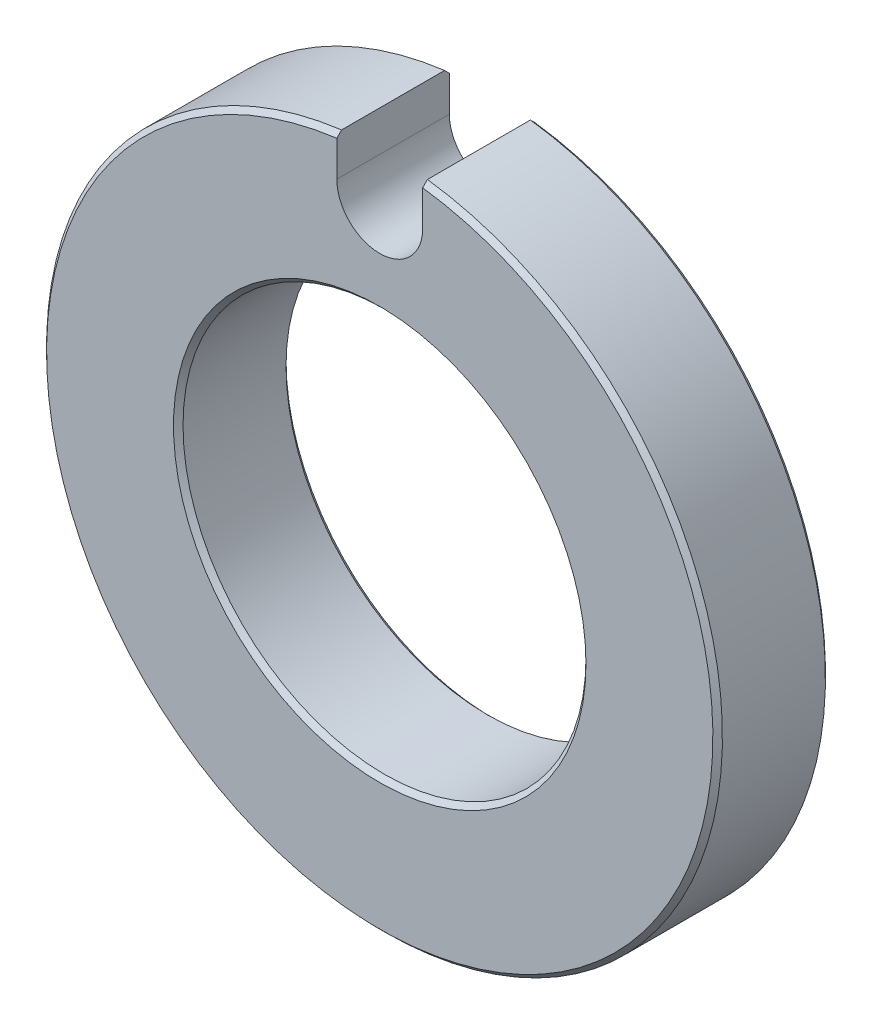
ISO-10303-21;
HEADER;
FILE_DESCRIPTION(('STEP AP214'),'2;1');
FILE_NAME('part.step','',(''),(''),'','','');
FILE_SCHEMA(('AUTOMOTIVE_DESIGN { 1 0 10303 214 1 1 1 1 }'));
ENDSEC;
DATA;
#1=APPLICATION_CONTEXT('core data for automotive mechanical design processes');
#2=APPLICATION_PROTOCOL_DEFINITION('international standard','automotive_design',2000,#1);
#3=PRODUCT_CONTEXT('',#1,'mechanical');
#4=PRODUCT('Part','Part','',(#3));
#5=PRODUCT_RELATED_PRODUCT_CATEGORY('part','',(#4));
#6=PRODUCT_DEFINITION_FORMATION('','',#4);
#7=PRODUCT_DEFINITION_CONTEXT('part definition',#1,'design');
#8=PRODUCT_DEFINITION('design','',#6,#7);
#9=PRODUCT_DEFINITION_SHAPE('','',#8);
#10=(LENGTH_UNIT() NAMED_UNIT(*) SI_UNIT(.MILLI.,.METRE.));
#11=(NAMED_UNIT(*) PLANE_ANGLE_UNIT() SI_UNIT($,.RADIAN.));
#12=(NAMED_UNIT(*) SI_UNIT($,.STERADIAN.) SOLID_ANGLE_UNIT());
#13=UNCERTAINTY_MEASURE_WITH_UNIT(LENGTH_MEASURE(1.E-05),#10,'distance_accuracy_value','');
#14=(GEOMETRIC_REPRESENTATION_CONTEXT(3) GLOBAL_UNCERTAINTY_ASSIGNED_CONTEXT((#13)) GLOBAL_UNIT_ASSIGNED_CONTEXT((#10,
#11,#12)) REPRESENTATION_CONTEXT('',''));
#15=CARTESIAN_POINT('',(0.,0.,0.));
#16=DIRECTION('',(0.,0.,1.));
#17=DIRECTION('',(1.,0.,0.));
#18=AXIS2_PLACEMENT_3D('',#15,#16,#17);
#19=CARTESIAN_POINT('',(0.,0.,5.9944));
#20=DIRECTION('',(0.,0.,1.));
#21=DIRECTION('',(1.,0.,0.));
#22=AXIS2_PLACEMENT_3D('',#19,#20,#21);
#23=PLANE('',#22);
#24=CARTESIAN_POINT('',(0.,0.,5.9944));
#25=DIRECTION('',(0.,0.,1.));
#26=DIRECTION('',(1.,0.,0.));
#27=AXIS2_PLACEMENT_3D('',#24,#25,#26);
#28=CIRCLE('',#27,10.9855);
#29=CARTESIAN_POINT('',(10.9855,0.,5.9944));
#30=VERTEX_POINT('',#29);
#31=EDGE_CURVE('E205',#30,#30,#28,.F.);
#32=ORIENTED_EDGE('',*,*,#31,.T.);
#33=EDGE_LOOP('',(#32));
#34=FACE_BOUND('',#33,.T.);
#35=CARTESIAN_POINT('',(0.,0.,5.9944));
#36=DIRECTION('',(0.,0.,1.));
#37=DIRECTION('',(1.,0.,0.));
#38=AXIS2_PLACEMENT_3D('',#35,#36,#37);
#39=CIRCLE('',#38,17.746);
#40=CARTESIAN_POINT('',(-2.286,17.5981453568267,5.9944));
#41=VERTEX_POINT('',#40);
#42=CARTESIAN_POINT('',(2.286,17.5981453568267,5.9944));
#43=VERTEX_POINT('',#42);
#44=EDGE_CURVE('E115',#41,#43,#39,.T.);
#45=ORIENTED_EDGE('',*,*,#44,.T.);
#46=DIRECTION('',(0.,1.,0.));
#47=VECTOR('',#46,1.);
#48=CARTESIAN_POINT('',(2.286,19.5199,5.9944));
#49=LINE('',#48,#47);
#50=CARTESIAN_POINT('',(2.286,15.7099,5.9944));
#51=VERTEX_POINT('',#50);
#52=EDGE_CURVE('E106',#51,#43,#49,.T.);
#53=ORIENTED_EDGE('',*,*,#52,.F.);
#54=CARTESIAN_POINT('',(0.,15.7099,5.9944));
#55=DIRECTION('',(0.,0.,1.));
#56=DIRECTION('',(1.,0.,0.));
#57=AXIS2_PLACEMENT_3D('',#54,#55,#56);
#58=CIRCLE('',#57,2.286);
#59=CARTESIAN_POINT('',(-2.286,15.7099,5.9944));
#60=VERTEX_POINT('',#59);
#61=EDGE_CURVE('E96',#60,#51,#58,.T.);
#62=ORIENTED_EDGE('',*,*,#61,.F.);
#63=DIRECTION('',(0.,-1.,0.));
#64=VECTOR('',#63,1.);
#65=CARTESIAN_POINT('',(-2.286,15.7099,5.9944));
#66=LINE('',#65,#64);
#67=EDGE_CURVE('E116',#41,#60,#66,.T.);
#68=ORIENTED_EDGE('',*,*,#67,.F.);
#69=EDGE_LOOP('',(#45,#53,#62,#68));
#70=FACE_BOUND('',#69,.T.);
#71=ADVANCED_FACE('F37',(#34,#70),#23,.T.);
#72=CARTESIAN_POINT('',(0.,0.,0.));
#73=DIRECTION('',(0.,0.,1.));
#74=DIRECTION('',(1.,0.,0.));
#75=AXIS2_PLACEMENT_3D('',#72,#73,#74);
#76=PLANE('',#75);
#77=CARTESIAN_POINT('',(0.,0.,0.));
#78=DIRECTION('',(0.,0.,1.));
#79=DIRECTION('',(1.,0.,0.));
#80=AXIS2_PLACEMENT_3D('',#77,#78,#79);
#81=CIRCLE('',#80,10.9855);
#82=CARTESIAN_POINT('',(10.9855,0.,0.));
#83=VERTEX_POINT('',#82);
#84=EDGE_CURVE('E194',#83,#83,#81,.T.);
#85=ORIENTED_EDGE('',*,*,#84,.T.);
#86=EDGE_LOOP('',(#85));
#87=FACE_BOUND('',#86,.T.);
#88=DIRECTION('',(0.,1.,0.));
#89=VECTOR('',#88,1.);
#90=CARTESIAN_POINT('',(2.286,19.5199,0.));
#91=LINE('',#90,#89);
#92=CARTESIAN_POINT('',(2.286,15.7099,0.));
#93=VERTEX_POINT('',#92);
#94=CARTESIAN_POINT('',(2.286,17.5981453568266,0.));
#95=VERTEX_POINT('',#94);
#96=EDGE_CURVE('E111',#93,#95,#91,.T.);
#97=ORIENTED_EDGE('',*,*,#96,.T.);
#98=CARTESIAN_POINT('',(0.,0.,0.));
#99=DIRECTION('',(0.,0.,1.));
#100=DIRECTION('',(1.,0.,0.));
#101=AXIS2_PLACEMENT_3D('',#98,#99,#100);
#102=CIRCLE('',#101,17.746);
#103=CARTESIAN_POINT('',(-2.286,17.5981453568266,0.));
#104=VERTEX_POINT('',#103);
#105=EDGE_CURVE('E202',#95,#104,#102,.F.);
#106=ORIENTED_EDGE('',*,*,#105,.T.);
#107=DIRECTION('',(0.,-1.,0.));
#108=VECTOR('',#107,1.);
#109=CARTESIAN_POINT('',(-2.286,15.7099,0.));
#110=LINE('',#109,#108);
#111=CARTESIAN_POINT('',(-2.286,15.7099,0.));
#112=VERTEX_POINT('',#111);
#113=EDGE_CURVE('E107',#104,#112,#110,.T.);
#114=ORIENTED_EDGE('',*,*,#113,.T.);
#115=CARTESIAN_POINT('',(0.,15.7099,0.));
#116=DIRECTION('',(0.,0.,1.));
#117=DIRECTION('',(1.,0.,0.));
#118=AXIS2_PLACEMENT_3D('',#115,#116,#117);
#119=CIRCLE('',#118,2.286);
#120=EDGE_CURVE('E120',#112,#93,#119,.T.);
#121=ORIENTED_EDGE('',*,*,#120,.T.);
#122=EDGE_LOOP('',(#97,#106,#114,#121));
#123=FACE_BOUND('',#122,.T.);
#124=ADVANCED_FACE('F170',(#87,#123),#76,.F.);
#125=CARTESIAN_POINT('',(0.,0.,5.9944));
#126=DIRECTION('',(0.,0.,-1.));
#127=DIRECTION('',(-1.,0.,0.));
#128=AXIS2_PLACEMENT_3D('',#125,#126,#127);
#129=CYLINDRICAL_SURFACE('',#128,18.);
#130=DIRECTION('',(0.,0.,-1.));
#131=VECTOR('',#130,1.);
#132=CARTESIAN_POINT('',(2.286,17.8542489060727,5.9944));
#133=LINE('',#132,#131);
#134=CARTESIAN_POINT('',(2.286,17.8542489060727,5.74040000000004));
#135=VERTEX_POINT('',#134);
#136=CARTESIAN_POINT('',(2.286,17.8542489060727,0.254000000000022));
#137=VERTEX_POINT('',#136);
#138=EDGE_CURVE('E65',#135,#137,#133,.T.);
#139=ORIENTED_EDGE('',*,*,#138,.F.);
#140=CARTESIAN_POINT('',(0.,0.,5.74040000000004));
#141=DIRECTION('',(0.,0.,1.));
#142=DIRECTION('',(1.,0.,0.));
#143=AXIS2_PLACEMENT_3D('',#140,#141,#142);
#144=CIRCLE('',#143,18.);
#145=CARTESIAN_POINT('',(-2.286,17.8542489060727,5.74040000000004));
#146=VERTEX_POINT('',#145);
#147=EDGE_CURVE('E189',#135,#146,#144,.F.);
#148=ORIENTED_EDGE('',*,*,#147,.T.);
#149=DIRECTION('',(0.,0.,-1.));
#150=VECTOR('',#149,1.);
#151=CARTESIAN_POINT('',(-2.286,17.8542489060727,5.9944));
#152=LINE('',#151,#150);
#153=CARTESIAN_POINT('',(-2.286,17.8542489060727,0.254000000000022));
#154=VERTEX_POINT('',#153);
#155=EDGE_CURVE('E57',#154,#146,#152,.F.);
#156=ORIENTED_EDGE('',*,*,#155,.F.);
#157=CARTESIAN_POINT('',(0.,0.,0.254000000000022));
#158=DIRECTION('',(0.,0.,1.));
#159=DIRECTION('',(1.,0.,0.));
#160=AXIS2_PLACEMENT_3D('',#157,#158,#159);
#161=CIRCLE('',#160,18.);
#162=EDGE_CURVE('E191',#154,#137,#161,.T.);
#163=ORIENTED_EDGE('',*,*,#162,.T.);
#164=EDGE_LOOP('',(#139,#148,#156,#163));
#165=FACE_BOUND('',#164,.T.);
#166=ADVANCED_FACE('F176',(#165),#129,.T.);
#167=CARTESIAN_POINT('',(0.,0.,0.254000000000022));
#168=DIRECTION('',(0.,0.,1.));
#169=DIRECTION('',(1.,0.,0.));
#170=AXIS2_PLACEMENT_3D('',#167,#168,#169);
#171=CONICAL_SURFACE('',#170,18.,0.785398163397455);
#172=ORIENTED_EDGE('',*,*,#105,.F.);
#173=CARTESIAN_POINT('',(2.286,14.7410604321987,-2.82873957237));
#174=CARTESIAN_POINT('',(2.286,15.2380157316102,-2.33763869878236));
#175=CARTESIAN_POINT('',(2.286,15.7346953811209,-1.84625911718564));
#176=CARTESIAN_POINT('',(2.286,16.7276121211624,-0.863053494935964));
#177=CARTESIAN_POINT('',(2.286,17.2238492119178,-0.371227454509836));
#178=CARTESIAN_POINT('',(2.286,18.2159899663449,0.612760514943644));
#179=CARTESIAN_POINT('',(2.286,18.7118936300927,1.10492244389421));
#180=CARTESIAN_POINT('',(2.286,19.7034334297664,2.08951622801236));
#181=CARTESIAN_POINT('',(2.286,20.1990695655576,2.58194808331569));
#182=CARTESIAN_POINT('',(2.286,20.6946045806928,3.07448161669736));
#183=B_SPLINE_CURVE_WITH_KNOTS('',3,(#173,#174,#175,#176,#177,#178,#179,#180,#181,#182),
.UNSPECIFIED.,.F.,.F.,(4,2,2,2,4),(0.,2.09602011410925,4.1920391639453,6.28805773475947,
8.38407736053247),.UNSPECIFIED.);
#184=EDGE_CURVE('E192',#95,#137,#183,.T.);
#185=ORIENTED_EDGE('',*,*,#184,.T.);
#186=ORIENTED_EDGE('',*,*,#162,.F.);
#187=CARTESIAN_POINT('',(-2.286,20.6946045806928,3.07448161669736));
#188=CARTESIAN_POINT('',(-2.286,20.1990695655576,2.58194808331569));
#189=CARTESIAN_POINT('',(-2.286,19.7034334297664,2.08951622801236));
#190=CARTESIAN_POINT('',(-2.286,18.7118936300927,1.10492244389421));
#191=CARTESIAN_POINT('',(-2.286,18.2159899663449,0.612760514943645));
#192=CARTESIAN_POINT('',(-2.286,17.2238492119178,-0.371227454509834));
#193=CARTESIAN_POINT('',(-2.286,16.7276121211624,-0.863053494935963));
#194=CARTESIAN_POINT('',(-2.286,15.7346953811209,-1.84625911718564));
#195=CARTESIAN_POINT('',(-2.286,15.2380157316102,-2.33763869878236));
#196=CARTESIAN_POINT('',(-2.286,14.7410604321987,-2.82873957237));
#197=B_SPLINE_CURVE_WITH_KNOTS('',3,(#187,#188,#189,#190,#191,#192,#193,#194,#195,#196),
.UNSPECIFIED.,.F.,.F.,(4,2,2,2,4),(0.,2.096019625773,4.19203819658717,6.28805724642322,
8.38407736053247),.UNSPECIFIED.);
#198=EDGE_CURVE('E127',#154,#104,#197,.T.);
#199=ORIENTED_EDGE('',*,*,#198,.T.);
#200=EDGE_LOOP('',(#172,#185,#186,#199));
#201=FACE_BOUND('',#200,.T.);
#202=ADVANCED_FACE('F136',(#201),#171,.T.);
#203=CARTESIAN_POINT('',(0.,0.,5.9944));
#204=DIRECTION('',(0.,0.,-1.));
#205=DIRECTION('',(-1.,0.,0.));
#206=AXIS2_PLACEMENT_3D('',#203,#204,#205);
#207=CONICAL_SURFACE('',#206,17.746,0.785398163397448);
#208=ORIENTED_EDGE('',*,*,#147,.F.);
#209=CARTESIAN_POINT('',(2.286,20.6946045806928,2.91991838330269));
#210=CARTESIAN_POINT('',(2.286,20.1990695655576,3.41245191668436));
#211=CARTESIAN_POINT('',(2.286,19.7034334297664,3.90488377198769));
#212=CARTESIAN_POINT('',(2.286,18.7118936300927,4.88947755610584));
#213=CARTESIAN_POINT('',(2.286,18.2159899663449,5.3816394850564));
#214=CARTESIAN_POINT('',(2.286,17.2238492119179,6.36562745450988));
#215=CARTESIAN_POINT('',(2.286,16.7276121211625,6.85745349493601));
#216=CARTESIAN_POINT('',(2.286,15.734695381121,7.84065911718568));
#217=CARTESIAN_POINT('',(2.286,15.2380157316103,8.3320386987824));
#218=CARTESIAN_POINT('',(2.286,14.7410604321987,8.82313957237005));
#219=B_SPLINE_CURVE_WITH_KNOTS('',3,(#209,#210,#211,#212,#213,#214,#215,#216,#217,#218),
.UNSPECIFIED.,.F.,.F.,(4,2,2,2,4),(0.,2.09601962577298,4.19203819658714,6.28805724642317,
8.38407736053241),.UNSPECIFIED.);
#220=EDGE_CURVE('E11',#135,#43,#219,.T.);
#221=ORIENTED_EDGE('',*,*,#220,.T.);
#222=ORIENTED_EDGE('',*,*,#44,.F.);
#223=CARTESIAN_POINT('',(-2.286,14.7410604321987,8.82313957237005));
#224=CARTESIAN_POINT('',(-2.286,15.2380157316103,8.3320386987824));
#225=CARTESIAN_POINT('',(-2.286,15.734695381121,7.84065911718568));
#226=CARTESIAN_POINT('',(-2.286,16.7276121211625,6.85745349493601));
#227=CARTESIAN_POINT('',(-2.286,17.2238492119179,6.36562745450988));
#228=CARTESIAN_POINT('',(-2.286,18.2159899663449,5.3816394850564));
#229=CARTESIAN_POINT('',(-2.286,18.7118936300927,4.88947755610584));
#230=CARTESIAN_POINT('',(-2.286,19.7034334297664,3.90488377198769));
#231=CARTESIAN_POINT('',(-2.286,20.1990695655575,3.41245191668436));
#232=CARTESIAN_POINT('',(-2.286,20.6946045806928,2.91991838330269));
#233=B_SPLINE_CURVE_WITH_KNOTS('',3,(#223,#224,#225,#226,#227,#228,#229,#230,#231,#232),
.UNSPECIFIED.,.F.,.F.,(4,2,2,2,4),(0.,2.09602011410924,4.19203916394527,6.28805773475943,
8.38407736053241),.UNSPECIFIED.);
#234=EDGE_CURVE('E50',#41,#146,#233,.T.);
#235=ORIENTED_EDGE('',*,*,#234,.T.);
#236=EDGE_LOOP('',(#208,#221,#222,#235));
#237=FACE_BOUND('',#236,.T.);
#238=ADVANCED_FACE('F151',(#237),#207,.T.);
#239=CARTESIAN_POINT('',(0.,0.,5.9944));
#240=DIRECTION('',(0.,0.,-1.));
#241=DIRECTION('',(-1.,0.,0.));
#242=AXIS2_PLACEMENT_3D('',#239,#240,#241);
#243=CYLINDRICAL_SURFACE('',#242,10.7315);
#244=CARTESIAN_POINT('',(0.,0.,0.253999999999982));
#245=DIRECTION('',(0.,0.,1.));
#246=DIRECTION('',(1.,0.,0.));
#247=AXIS2_PLACEMENT_3D('',#244,#245,#246);
#248=CIRCLE('',#247,10.7315);
#249=CARTESIAN_POINT('',(-10.7315,0.,0.253999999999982));
#250=VERTEX_POINT('',#249);
#251=EDGE_CURVE('E149',#250,#250,#248,.F.);
#252=CARTESIAN_POINT('',(0.,0.,5.74039999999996));
#253=DIRECTION('',(0.,0.,1.));
#254=DIRECTION('',(1.,0.,0.));
#255=AXIS2_PLACEMENT_3D('',#252,#253,#254);
#256=CIRCLE('',#255,10.7315);
#257=CARTESIAN_POINT('',(-10.7315,0.,5.74039999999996));
#258=VERTEX_POINT('',#257);
#259=EDGE_CURVE('E207',#258,#258,#256,.T.);
#260=CARTESIAN_POINT('',(-10.7315,0.,0.253999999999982));
#261=CARTESIAN_POINT('',(-10.7315,0.,0.311149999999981));
#262=CARTESIAN_POINT('',(-10.7315,0.,0.368299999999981));
#263=CARTESIAN_POINT('',(-10.7315,0.,0.482599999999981));
#264=CARTESIAN_POINT('',(-10.7315,0.,0.53974999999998));
#265=CARTESIAN_POINT('',(-10.7315,0.,0.65404999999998));
#266=CARTESIAN_POINT('',(-10.7315,0.,0.71119999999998));
#267=CARTESIAN_POINT('',(-10.7315,0.,0.82549999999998));
#268=CARTESIAN_POINT('',(-10.7315,0.,0.88264999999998));
#269=CARTESIAN_POINT('',(-10.7315,0.,0.996949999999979));
#270=CARTESIAN_POINT('',(-10.7315,0.,1.05409999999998));
#271=CARTESIAN_POINT('',(-10.7315,0.,1.16839999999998));
#272=CARTESIAN_POINT('',(-10.7315,0.,1.22554999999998));
#273=CARTESIAN_POINT('',(-10.7315,0.,1.33984999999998));
#274=CARTESIAN_POINT('',(-10.7315,0.,1.39699999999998));
#275=CARTESIAN_POINT('',(-10.7315,0.,1.51129999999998));
#276=CARTESIAN_POINT('',(-10.7315,0.,1.56844999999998));
#277=CARTESIAN_POINT('',(-10.7315,0.,1.68274999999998));
#278=CARTESIAN_POINT('',(-10.7315,0.,1.73989999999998));
#279=CARTESIAN_POINT('',(-10.7315,0.,1.85419999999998));
#280=CARTESIAN_POINT('',(-10.7315,0.,1.91134999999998));
#281=CARTESIAN_POINT('',(-10.7315,0.,2.02564999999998));
#282=CARTESIAN_POINT('',(-10.7315,0.,2.08279999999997));
#283=CARTESIAN_POINT('',(-10.7315,0.,2.19709999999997));
#284=CARTESIAN_POINT('',(-10.7315,0.,2.25424999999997));
#285=CARTESIAN_POINT('',(-10.7315,0.,2.36854999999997));
#286=CARTESIAN_POINT('',(-10.7315,0.,2.42569999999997));
#287=CARTESIAN_POINT('',(-10.7315,0.,2.53999999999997));
#288=CARTESIAN_POINT('',(-10.7315,0.,2.59714999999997));
#289=CARTESIAN_POINT('',(-10.7315,0.,2.71144999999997));
#290=CARTESIAN_POINT('',(-10.7315,0.,2.76859999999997));
#291=CARTESIAN_POINT('',(-10.7315,0.,2.88289999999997));
#292=CARTESIAN_POINT('',(-10.7315,0.,2.94004999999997));
#293=CARTESIAN_POINT('',(-10.7315,0.,3.05434999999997));
#294=CARTESIAN_POINT('',(-10.7315,0.,3.11149999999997));
#295=CARTESIAN_POINT('',(-10.7315,0.,3.22579999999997));
#296=CARTESIAN_POINT('',(-10.7315,0.,3.28294999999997));
#297=CARTESIAN_POINT('',(-10.7315,0.,3.39724999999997));
#298=CARTESIAN_POINT('',(-10.7315,0.,3.45439999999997));
#299=CARTESIAN_POINT('',(-10.7315,0.,3.56869999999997));
#300=CARTESIAN_POINT('',(-10.7315,0.,3.62584999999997));
#301=CARTESIAN_POINT('',(-10.7315,0.,3.74014999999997));
#302=CARTESIAN_POINT('',(-10.7315,0.,3.79729999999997));
#303=CARTESIAN_POINT('',(-10.7315,0.,3.91159999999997));
#304=CARTESIAN_POINT('',(-10.7315,0.,3.96874999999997));
#305=CARTESIAN_POINT('',(-10.7315,0.,4.08304999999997));
#306=CARTESIAN_POINT('',(-10.7315,0.,4.14019999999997));
#307=CARTESIAN_POINT('',(-10.7315,0.,4.25449999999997));
#308=CARTESIAN_POINT('',(-10.7315,0.,4.31164999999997));
#309=CARTESIAN_POINT('',(-10.7315,0.,4.42594999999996));
#310=CARTESIAN_POINT('',(-10.7315,0.,4.48309999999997));
#311=CARTESIAN_POINT('',(-10.7315,0.,4.59739999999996));
#312=CARTESIAN_POINT('',(-10.7315,0.,4.65454999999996));
#313=CARTESIAN_POINT('',(-10.7315,0.,4.76884999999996));
#314=CARTESIAN_POINT('',(-10.7315,0.,4.82599999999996));
#315=CARTESIAN_POINT('',(-10.7315,0.,4.94029999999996));
#316=CARTESIAN_POINT('',(-10.7315,0.,4.99744999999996));
#317=CARTESIAN_POINT('',(-10.7315,0.,5.11174999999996));
#318=CARTESIAN_POINT('',(-10.7315,0.,5.16889999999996));
#319=CARTESIAN_POINT('',(-10.7315,0.,5.28319999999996));
#320=CARTESIAN_POINT('',(-10.7315,0.,5.34034999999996));
#321=CARTESIAN_POINT('',(-10.7315,0.,5.45464999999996));
#322=CARTESIAN_POINT('',(-10.7315,0.,5.51179999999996));
#323=CARTESIAN_POINT('',(-10.7315,0.,5.62609999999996));
#324=CARTESIAN_POINT('',(-10.7315,0.,5.68324999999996));
#325=CARTESIAN_POINT('',(-10.7315,0.,5.74039999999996));
#326=B_SPLINE_CURVE_WITH_KNOTS('',3,(#260,#261,#262,#263,#264,#265,#266,#267,#268,#269,#270,
#271,#272,#273,#274,#275,#276,#277,#278,#279,#280,#281,#282,#283,#284,#285,#286,#287,#288,#289,
#290,#291,#292,#293,#294,#295,#296,#297,#298,#299,#300,#301,#302,#303,#304,#305,#306,#307,#308,
#309,#310,#311,#312,#313,#314,#315,#316,#317,#318,#319,#320,#321,#322,#323,#324,#325),
.UNSPECIFIED.,.F.,.F.,(4,2,2,2,2,2,2,2,2,2,2,2,2,2,2,2,2,2,2,2,2,2,2,2,2,2,2,2,2,2,2,2,4),(0.,
0.171449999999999,0.342899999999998,0.514349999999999,0.685799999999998,0.857249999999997,
1.0287,1.20015,1.3716,1.54304999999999,1.71449999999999,1.88594999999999,2.05739999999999,
2.22884999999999,2.40029999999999,2.57174999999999,2.74319999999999,2.91464999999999,
3.08609999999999,3.25754999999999,3.42899999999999,3.60044999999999,3.77189999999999,
3.94334999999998,4.11479999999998,4.28624999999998,4.45769999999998,4.62914999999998,
4.80059999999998,4.97204999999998,5.14349999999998,5.31494999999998,5.48639999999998),.UNSPECIFIED.);
#327=EDGE_CURVE('BSEAM154',#250,#258,#326,.T.);
#328=ORIENTED_EDGE('',*,*,#251,.T.);
#329=ORIENTED_EDGE('',*,*,#259,.T.);
#330=ORIENTED_EDGE('',*,*,#327,.T.);
#331=ORIENTED_EDGE('',*,*,#327,.F.);
#332=EDGE_LOOP('',(#328,#330,#329,#331));
#333=FACE_BOUND('',#332,.T.);
#334=ADVANCED_FACE('F154',(#333),#243,.F.);
#335=CARTESIAN_POINT('',(0.,0.,0.));
#336=DIRECTION('',(0.,0.,-1.));
#337=DIRECTION('',(-1.,0.,0.));
#338=AXIS2_PLACEMENT_3D('',#335,#336,#337);
#339=CONICAL_SURFACE('',#338,10.9855,0.785398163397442);
#340=ORIENTED_EDGE('',*,*,#251,.F.);
#341=EDGE_LOOP('',(#340));
#342=FACE_BOUND('',#341,.T.);
#343=ORIENTED_EDGE('',*,*,#84,.F.);
#344=EDGE_LOOP('',(#343));
#345=FACE_BOUND('',#344,.T.);
#346=ADVANCED_FACE('F156',(#342,#345),#339,.F.);
#347=CARTESIAN_POINT('',(0.,0.,5.74039999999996));
#348=DIRECTION('',(0.,0.,1.));
#349=DIRECTION('',(1.,0.,0.));
#350=AXIS2_PLACEMENT_3D('',#347,#348,#349);
#351=CONICAL_SURFACE('',#350,10.7315,0.785398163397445);
#352=ORIENTED_EDGE('',*,*,#31,.F.);
#353=EDGE_LOOP('',(#352));
#354=FACE_BOUND('',#353,.T.);
#355=ORIENTED_EDGE('',*,*,#259,.F.);
#356=EDGE_LOOP('',(#355));
#357=FACE_BOUND('',#356,.T.);
#358=ADVANCED_FACE('F39',(#354,#357),#351,.F.);
#359=CARTESIAN_POINT('',(0.,15.7099,5.9944));
#360=DIRECTION('',(0.,0.,-1.));
#361=DIRECTION('',(-1.,0.,0.));
#362=AXIS2_PLACEMENT_3D('',#359,#360,#361);
#363=CYLINDRICAL_SURFACE('',#362,2.286);
#364=ORIENTED_EDGE('',*,*,#120,.F.);
#365=DIRECTION('',(0.,0.,-1.));
#366=VECTOR('',#365,1.);
#367=CARTESIAN_POINT('',(-2.286,15.7099,5.9944));
#368=LINE('',#367,#366);
#369=EDGE_CURVE('E102',#60,#112,#368,.T.);
#370=ORIENTED_EDGE('',*,*,#369,.F.);
#371=ORIENTED_EDGE('',*,*,#61,.T.);
#372=DIRECTION('',(0.,0.,-1.));
#373=VECTOR('',#372,1.);
#374=CARTESIAN_POINT('',(2.286,15.7099,5.9944));
#375=LINE('',#374,#373);
#376=EDGE_CURVE('E100',#51,#93,#375,.T.);
#377=ORIENTED_EDGE('',*,*,#376,.T.);
#378=EDGE_LOOP('',(#364,#370,#371,#377));
#379=FACE_BOUND('',#378,.T.);
#380=ADVANCED_FACE('F99',(#379),#363,.F.);
#381=CARTESIAN_POINT('',(2.286,19.5199,5.9944));
#382=DIRECTION('',(-1.,0.,0.));
#383=DIRECTION('',(0.,-1.,0.));
#384=AXIS2_PLACEMENT_3D('',#381,#382,#383);
#385=PLANE('',#384);
#386=ORIENTED_EDGE('',*,*,#96,.F.);
#387=ORIENTED_EDGE('',*,*,#376,.F.);
#388=ORIENTED_EDGE('',*,*,#52,.T.);
#389=ORIENTED_EDGE('',*,*,#220,.F.);
#390=ORIENTED_EDGE('',*,*,#138,.T.);
#391=ORIENTED_EDGE('',*,*,#184,.F.);
#392=EDGE_LOOP('',(#386,#387,#388,#389,#390,#391));
#393=FACE_BOUND('',#392,.T.);
#394=ADVANCED_FACE('F109',(#393),#385,.T.);
#395=CARTESIAN_POINT('',(-2.286,15.7099,5.9944));
#396=DIRECTION('',(1.,0.,0.));
#397=DIRECTION('',(0.,1.,0.));
#398=AXIS2_PLACEMENT_3D('',#395,#396,#397);
#399=PLANE('',#398);
#400=ORIENTED_EDGE('',*,*,#155,.T.);
#401=ORIENTED_EDGE('',*,*,#234,.F.);
#402=ORIENTED_EDGE('',*,*,#67,.T.);
#403=ORIENTED_EDGE('',*,*,#369,.T.);
#404=ORIENTED_EDGE('',*,*,#113,.F.);
#405=ORIENTED_EDGE('',*,*,#198,.F.);
#406=EDGE_LOOP('',(#400,#401,#402,#403,#404,#405));
#407=FACE_BOUND('',#406,.T.);
#408=ADVANCED_FACE('F139',(#407),#399,.T.);
#409=CLOSED_SHELL('',(#71,#124,#166,#202,#238,#334,#346,#358,#380,#394,#408));
#410=MANIFOLD_SOLID_BREP('B2',#409);
#411=ADVANCED_BREP_SHAPE_REPRESENTATION('',(#18,#410),#14);
#412=SHAPE_DEFINITION_REPRESENTATION(#9,#411);
ENDSEC;
END-ISO-10303-21;
